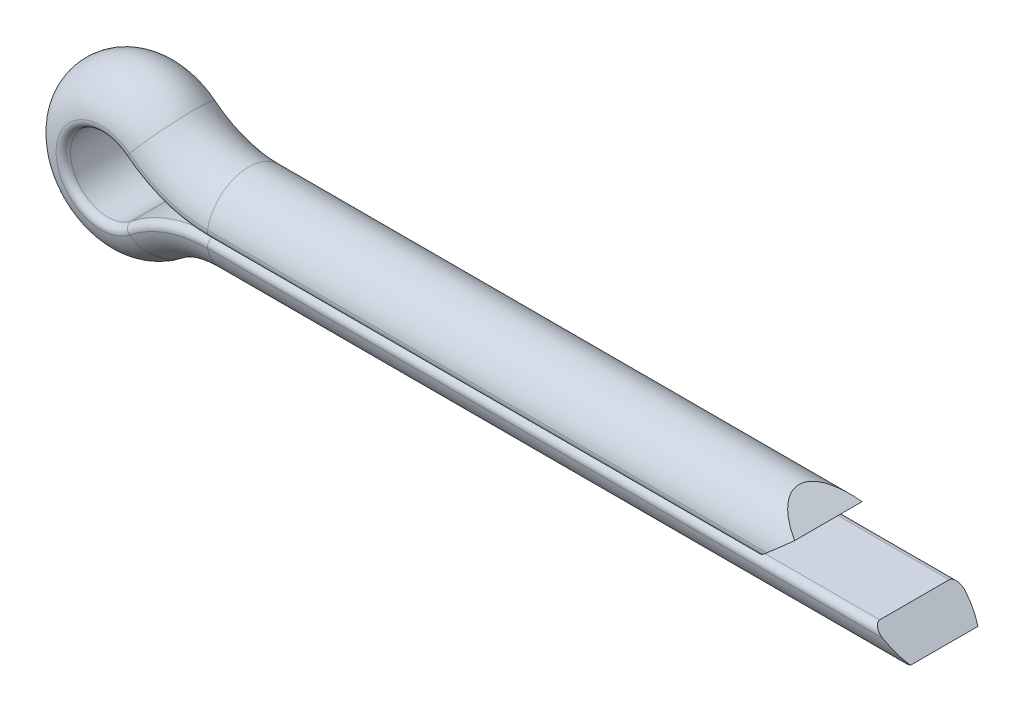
from build123d import *

# Parameters (mm, degrees)
CONECUT_DEPTH      = 28.836502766
CONECUT_DEPTH_BACK = 28.836502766


with BuildPart() as part:
    # BaseBody: sweep along a path in PathSke
    with BuildLine(Plane.XY) as basebody_path:
        Line((23.665, 1.45), (3.665, 1.45))
        ThreePointArc((3.665, 1.45), (2.628048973, 1.626517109), (1.707905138, 2.136184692))
        ThreePointArc((1.707905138, 2.136184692), (-2.735, 0), (1.707905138, -2.136184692))
        ThreePointArc((1.707905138, -2.136184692), (2.628048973, -1.626517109), (3.665, -1.45))
        Line((3.665, -1.45), (27.665, -1.45))
    # SectionSke → BaseBody (sweep)
    with BuildSketch(Plane(origin=(23.665, 1.45, 0), x_dir=(0, 0, -1), z_dir=(1, 0, 0))):
        with BuildLine():
            Line((-1.197737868, -1.448), (1.197737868, -1.448))
            ThreePointArc((1.197737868, -1.448), (1.375163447, -1.364356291), (1.423540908, -1.174262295))
            ThreePointArc((1.423540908, -1.174262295), (0, 0), (-1.423540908, -1.174262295))
            ThreePointArc((-1.423540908, -1.174262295), (-1.375163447, -1.364356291), (-1.197737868, -1.448))
        make_face()
    sweep(path=basebody_path.line)

    # ConeCutSke → ConeCut (cut, two sides: drawn at the far end of the back side and taken through both)
    with BuildSketch(Plane.XY.offset(-CONECUT_DEPTH_BACK)):
        Polygon((22.633898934, 1.46), (27.675, 1.46), (27.675, -1.46), (26.633898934, -1.46), (27.665, -0.862868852), (26.633898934, 0), (22.633898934, 0), (23.665, 0.862868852), align=None)
    extrude(amount=CONECUT_DEPTH + CONECUT_DEPTH_BACK, mode=Mode.SUBTRACT)


solid = part.part
